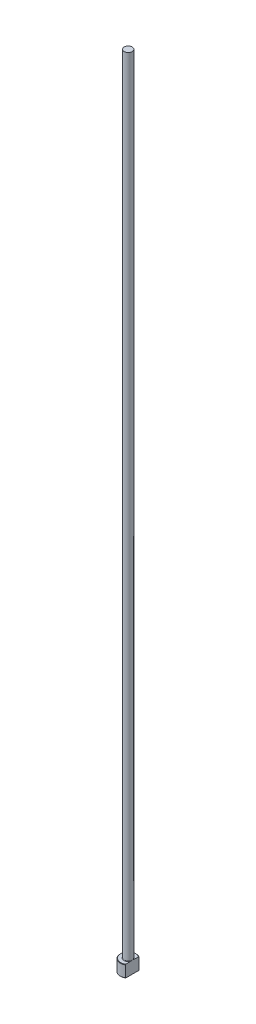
ISO-10303-21;
HEADER;
FILE_DESCRIPTION(('STEP AP214'),'2;1');
FILE_NAME('part.step','',(''),(''),'','','');
FILE_SCHEMA(('AUTOMOTIVE_DESIGN { 1 0 10303 214 1 1 1 1 }'));
ENDSEC;
DATA;
#1=APPLICATION_CONTEXT('core data for automotive mechanical design processes');
#2=APPLICATION_PROTOCOL_DEFINITION('international standard','automotive_design',2000,#1);
#3=PRODUCT_CONTEXT('',#1,'mechanical');
#4=PRODUCT('Part','Part','',(#3));
#5=PRODUCT_RELATED_PRODUCT_CATEGORY('part','',(#4));
#6=PRODUCT_DEFINITION_FORMATION('','',#4);
#7=PRODUCT_DEFINITION_CONTEXT('part definition',#1,'design');
#8=PRODUCT_DEFINITION('design','',#6,#7);
#9=PRODUCT_DEFINITION_SHAPE('','',#8);
#10=(LENGTH_UNIT() NAMED_UNIT(*) SI_UNIT(.MILLI.,.METRE.));
#11=(NAMED_UNIT(*) PLANE_ANGLE_UNIT() SI_UNIT($,.RADIAN.));
#12=(NAMED_UNIT(*) SI_UNIT($,.STERADIAN.) SOLID_ANGLE_UNIT());
#13=UNCERTAINTY_MEASURE_WITH_UNIT(LENGTH_MEASURE(1.E-05),#10,'distance_accuracy_value','');
#14=(GEOMETRIC_REPRESENTATION_CONTEXT(3) GLOBAL_UNCERTAINTY_ASSIGNED_CONTEXT((#13)) GLOBAL_UNIT_ASSIGNED_CONTEXT((#10,
#11,#12)) REPRESENTATION_CONTEXT('',''));
#15=CARTESIAN_POINT('',(0.,0.,0.));
#16=DIRECTION('',(0.,0.,1.));
#17=DIRECTION('',(1.,0.,0.));
#18=AXIS2_PLACEMENT_3D('',#15,#16,#17);
#19=CARTESIAN_POINT('',(0.,0.,0.));
#20=DIRECTION('',(0.,-1.,0.));
#21=DIRECTION('',(0.,0.,-1.));
#22=AXIS2_PLACEMENT_3D('',#19,#20,#21);
#23=PLANE('',#22);
#24=CARTESIAN_POINT('',(0.,0.,0.));
#25=DIRECTION('',(0.,-1.,0.));
#26=DIRECTION('',(0.,0.,-1.));
#27=AXIS2_PLACEMENT_3D('',#24,#25,#26);
#28=CIRCLE('',#27,3.80000000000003);
#29=CARTESIAN_POINT('',(1.99999999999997,0.,3.23109888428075));
#30=VERTEX_POINT('',#29);
#31=CARTESIAN_POINT('',(1.99999999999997,0.,-3.23109888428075));
#32=VERTEX_POINT('',#31);
#33=EDGE_CURVE('E98',#30,#32,#28,.T.);
#34=ORIENTED_EDGE('',*,*,#33,.T.);
#35=DIRECTION('',(0.,0.,1.));
#36=VECTOR('',#35,1.);
#37=CARTESIAN_POINT('',(1.99999999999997,0.,3.46410161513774));
#38=LINE('',#37,#36);
#39=EDGE_CURVE('E83',#32,#30,#38,.T.);
#40=ORIENTED_EDGE('',*,*,#39,.T.);
#41=EDGE_LOOP('',(#34,#40));
#42=FACE_BOUND('',#41,.T.);
#43=ADVANCED_FACE('F32',(#42),#23,.T.);
#44=CARTESIAN_POINT('',(0.,259.958771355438,0.));
#45=DIRECTION('',(0.,1.,0.));
#46=DIRECTION('',(0.,0.,1.));
#47=AXIS2_PLACEMENT_3D('',#44,#45,#46);
#48=CYLINDRICAL_SURFACE('',#47,3.99999999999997);
#49=CARTESIAN_POINT('',(0.,5.79999999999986,0.));
#50=DIRECTION('',(0.,1.,0.));
#51=DIRECTION('',(0.,0.,1.));
#52=AXIS2_PLACEMENT_3D('',#49,#50,#51);
#53=CIRCLE('',#52,3.99999999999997);
#54=CARTESIAN_POINT('',(1.99999999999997,5.79999999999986,3.46410161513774));
#55=VERTEX_POINT('',#54);
#56=CARTESIAN_POINT('',(1.99999999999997,5.79999999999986,-3.46410161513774));
#57=VERTEX_POINT('',#56);
#58=EDGE_CURVE('E104',#55,#57,#53,.F.);
#59=ORIENTED_EDGE('',*,*,#58,.T.);
#60=DIRECTION('',(0.,-1.,0.));
#61=VECTOR('',#60,1.);
#62=CARTESIAN_POINT('',(1.99999999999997,400.,-3.46410161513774));
#63=LINE('',#62,#61);
#64=CARTESIAN_POINT('',(1.99999999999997,0.199999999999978,-3.46410161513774));
#65=VERTEX_POINT('',#64);
#66=EDGE_CURVE('E183',#57,#65,#63,.T.);
#67=ORIENTED_EDGE('',*,*,#66,.T.);
#68=CARTESIAN_POINT('',(0.,0.199999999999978,0.));
#69=DIRECTION('',(0.,-1.,0.));
#70=DIRECTION('',(0.,0.,-1.));
#71=AXIS2_PLACEMENT_3D('',#68,#69,#70);
#72=CIRCLE('',#71,3.99999999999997);
#73=CARTESIAN_POINT('',(1.99999999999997,0.199999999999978,3.46410161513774));
#74=VERTEX_POINT('',#73);
#75=EDGE_CURVE('E100',#65,#74,#72,.F.);
#76=ORIENTED_EDGE('',*,*,#75,.T.);
#77=DIRECTION('',(0.,-1.,0.));
#78=VECTOR('',#77,1.);
#79=CARTESIAN_POINT('',(1.99999999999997,400.,3.46410161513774));
#80=LINE('',#79,#78);
#81=EDGE_CURVE('E93',#55,#74,#80,.T.);
#82=ORIENTED_EDGE('',*,*,#81,.F.);
#83=EDGE_LOOP('',(#59,#67,#76,#82));
#84=FACE_BOUND('',#83,.T.);
#85=ADVANCED_FACE('F158',(#84),#48,.T.);
#86=CARTESIAN_POINT('',(-3.99999999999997,6.,0.));
#87=DIRECTION('',(0.,1.,0.));
#88=DIRECTION('',(0.,0.,1.));
#89=AXIS2_PLACEMENT_3D('',#86,#87,#88);
#90=PLANE('',#89);
#91=CARTESIAN_POINT('',(0.,6.,0.));
#92=DIRECTION('',(0.,1.,0.));
#93=DIRECTION('',(0.,0.,1.));
#94=AXIS2_PLACEMENT_3D('',#91,#92,#93);
#95=CIRCLE('',#94,3.79999999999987);
#96=CARTESIAN_POINT('',(1.99999999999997,6.,-3.23109888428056));
#97=VERTEX_POINT('',#96);
#98=CARTESIAN_POINT('',(1.99999999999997,6.,3.23109888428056));
#99=VERTEX_POINT('',#98);
#100=EDGE_CURVE('E178',#97,#99,#95,.T.);
#101=ORIENTED_EDGE('',*,*,#100,.T.);
#102=DIRECTION('',(0.,0.,-1.));
#103=VECTOR('',#102,1.);
#104=CARTESIAN_POINT('',(1.99999999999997,6.,0.));
#105=LINE('',#104,#103);
#106=CARTESIAN_POINT('',(1.99999999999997,5.99999999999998,0.916515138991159));
#107=VERTEX_POINT('',#106);
#108=EDGE_CURVE('E57',#99,#107,#105,.T.);
#109=ORIENTED_EDGE('',*,*,#108,.T.);
#110=CARTESIAN_POINT('',(0.,6.,0.));
#111=DIRECTION('',(0.,1.,0.));
#112=DIRECTION('',(0.,0.,1.));
#113=AXIS2_PLACEMENT_3D('',#110,#111,#112);
#114=CIRCLE('',#113,2.19999999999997);
#115=CARTESIAN_POINT('',(1.99999999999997,5.99999999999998,-0.916515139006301));
#116=VERTEX_POINT('',#115);
#117=EDGE_CURVE('E107',#107,#116,#114,.F.);
#118=ORIENTED_EDGE('',*,*,#117,.T.);
#119=EDGE_CURVE('E136',#116,#97,#105,.T.);
#120=ORIENTED_EDGE('',*,*,#119,.T.);
#121=EDGE_LOOP('',(#101,#109,#118,#120));
#122=FACE_BOUND('',#121,.T.);
#123=ADVANCED_FACE('F147',(#122),#90,.T.);
#124=CARTESIAN_POINT('',(0.,6.00000000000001,0.));
#125=DIRECTION('',(0.,-1.,0.));
#126=DIRECTION('',(0.,0.,-1.));
#127=AXIS2_PLACEMENT_3D('',#124,#125,#126);
#128=CONICAL_SURFACE('',#127,3.79999999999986,0.785398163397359);
#129=ORIENTED_EDGE('',*,*,#58,.F.);
#130=CARTESIAN_POINT('',(1.99999999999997,1.91904532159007,7.62295524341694));
#131=CARTESIAN_POINT('',(1.99999999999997,2.08611243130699,7.4502239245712));
#132=CARTESIAN_POINT('',(1.99999999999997,2.25300024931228,7.27731861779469));
#133=CARTESIAN_POINT('',(1.99999999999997,2.58631125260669,6.93105655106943));
#134=CARTESIAN_POINT('',(1.99999999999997,2.75273443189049,6.75769978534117));
#135=CARTESIAN_POINT('',(1.99999999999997,3.0850908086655,6.41034692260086));
#136=CARTESIAN_POINT('',(1.99999999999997,3.2510237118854,6.23635054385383));
#137=CARTESIAN_POINT('',(1.99999999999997,3.58215598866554,5.88766284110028));
#138=CARTESIAN_POINT('',(1.99999999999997,3.74735536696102,5.71297152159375));
#139=CARTESIAN_POINT('',(1.99999999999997,4.07353855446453,5.36616839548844));
#140=CARTESIAN_POINT('',(1.99999999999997,4.23454099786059,5.19407412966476));
#141=CARTESIAN_POINT('',(1.99999999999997,4.55534102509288,4.8487666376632));
#142=CARTESIAN_POINT('',(1.99999999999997,4.71513861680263,4.67555341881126));
#143=CARTESIAN_POINT('',(1.99999999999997,5.03306183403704,4.32766569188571));
#144=CARTESIAN_POINT('',(1.99999999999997,5.19118781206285,4.15299150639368));
#145=CARTESIAN_POINT('',(1.99999999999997,5.50513944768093,3.80159134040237));
#146=CARTESIAN_POINT('',(1.99999999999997,5.66096519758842,3.62486544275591));
#147=CARTESIAN_POINT('',(1.99999999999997,5.90974646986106,3.33722425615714));
#148=CARTESIAN_POINT('',(1.99999999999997,6.00376148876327,3.22722645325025));
#149=CARTESIAN_POINT('',(1.99999999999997,6.19011825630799,3.00579987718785));
#150=CARTESIAN_POINT('',(1.99999999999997,6.28245983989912,2.89437096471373));
#151=CARTESIAN_POINT('',(1.99999999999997,6.46586188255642,2.66849662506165));
#152=CARTESIAN_POINT('',(1.99999999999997,6.5568984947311,2.55403176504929));
#153=CARTESIAN_POINT('',(1.99999999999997,6.7357880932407,2.32266819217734));
#154=CARTESIAN_POINT('',(1.99999999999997,6.82364184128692,2.20577007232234));
#155=CARTESIAN_POINT('',(1.99999999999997,6.9961275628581,1.96688707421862));
#156=CARTESIAN_POINT('',(1.99999999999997,7.08069035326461,1.84485190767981));
#157=CARTESIAN_POINT('',(1.99999999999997,7.24300264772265,1.59599329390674));
#158=CARTESIAN_POINT('',(1.99999999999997,7.32074277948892,1.46916359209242));
#159=CARTESIAN_POINT('',(1.99999999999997,7.42869763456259,1.27510066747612));
#160=CARTESIAN_POINT('',(1.99999999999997,7.46305374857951,1.21018943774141));
#161=CARTESIAN_POINT('',(1.99999999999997,7.52837146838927,1.07868835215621));
#162=CARTESIAN_POINT('',(1.99999999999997,7.55933245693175,1.01209819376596));
#163=CARTESIAN_POINT('',(1.99999999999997,7.64566860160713,0.809894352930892));
#164=CARTESIAN_POINT('',(1.99999999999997,7.69478214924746,0.6713602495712));
#165=CARTESIAN_POINT('',(1.99999999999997,7.74794829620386,0.463657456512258));
#166=CARTESIAN_POINT('',(1.99999999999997,7.76205065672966,0.397033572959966));
#167=CARTESIAN_POINT('',(1.99999999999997,7.78390371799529,0.262728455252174));
#168=CARTESIAN_POINT('',(1.99999999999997,7.79165498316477,0.195047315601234));
#169=CARTESIAN_POINT('',(1.99999999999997,7.80025690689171,0.0594528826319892));
#170=CARTESIAN_POINT('',(1.99999999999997,7.801128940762,-0.0084590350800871));
#171=CARTESIAN_POINT('',(1.99999999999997,7.79596585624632,-0.144020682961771));
#172=CARTESIAN_POINT('',(1.99999999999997,7.78993016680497,-0.211670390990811));
#173=CARTESIAN_POINT('',(1.99999999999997,7.77145363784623,-0.345483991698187));
#174=CARTESIAN_POINT('',(1.99999999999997,7.75906777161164,-0.411655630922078));
#175=CARTESIAN_POINT('',(1.99999999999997,7.72866360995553,-0.542678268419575));
#176=CARTESIAN_POINT('',(1.99999999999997,7.71064463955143,-0.607529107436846));
#177=CARTESIAN_POINT('',(1.99999999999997,7.66972939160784,-0.736064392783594));
#178=CARTESIAN_POINT('',(1.99999999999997,7.64680564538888,-0.79973998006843));
#179=CARTESIAN_POINT('',(1.99999999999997,7.59700147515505,-0.925489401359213));
#180=CARTESIAN_POINT('',(1.99999999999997,7.57012185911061,-0.987563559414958));
#181=CARTESIAN_POINT('',(1.99999999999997,7.48443518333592,-1.17209020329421));
#182=CARTESIAN_POINT('',(1.99999999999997,7.42077407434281,-1.29228210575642));
#183=CARTESIAN_POINT('',(1.99999999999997,7.28502644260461,-1.52785770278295));
#184=CARTESIAN_POINT('',(1.99999999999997,7.21292931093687,-1.6432350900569));
#185=CARTESIAN_POINT('',(1.99999999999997,7.06281517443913,-1.87069387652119));
#186=CARTESIAN_POINT('',(1.99999999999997,6.984775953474,-1.98276048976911));
#187=CARTESIAN_POINT('',(1.99999999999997,6.82481971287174,-2.20397837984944));
#188=CARTESIAN_POINT('',(1.99999999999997,6.74290465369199,-2.31313108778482));
#189=CARTESIAN_POINT('',(1.99999999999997,6.57517222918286,-2.53068545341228));
#190=CARTESIAN_POINT('',(1.99999999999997,6.48931769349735,-2.63905831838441));
#191=CARTESIAN_POINT('',(1.99999999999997,6.31548151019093,-2.85409686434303));
#192=CARTESIAN_POINT('',(1.99999999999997,6.227499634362,-2.96076236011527));
#193=CARTESIAN_POINT('',(1.99999999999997,6.05015030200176,-3.17249211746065));
#194=CARTESIAN_POINT('',(1.99999999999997,5.96078672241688,-3.27755963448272));
#195=CARTESIAN_POINT('',(1.99999999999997,5.78082366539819,-3.48663191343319));
#196=CARTESIAN_POINT('',(1.99999999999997,5.69022416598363,-3.59063665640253));
#197=CARTESIAN_POINT('',(1.99999999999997,5.4479673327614,-3.86612439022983));
#198=CARTESIAN_POINT('',(1.99999999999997,5.29545972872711,-4.0368591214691));
#199=CARTESIAN_POINT('',(1.99999999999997,4.98858070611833,-4.37664803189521));
#200=CARTESIAN_POINT('',(1.99999999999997,4.83420923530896,-4.54570216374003));
#201=CARTESIAN_POINT('',(1.99999999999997,4.52396102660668,-4.88271638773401));
#202=CARTESIAN_POINT('',(1.99999999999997,4.36808300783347,-5.05067529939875));
#203=CARTESIAN_POINT('',(1.99999999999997,4.05530513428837,-5.38563883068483));
#204=CARTESIAN_POINT('',(1.99999999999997,3.89840527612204,-5.55264344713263));
#205=CARTESIAN_POINT('',(1.99999999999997,3.59029018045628,-5.87905385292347));
#206=CARTESIAN_POINT('',(1.99999999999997,3.43910664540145,-6.03848959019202));
#207=CARTESIAN_POINT('',(1.99999999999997,3.13616436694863,-6.35681456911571));
#208=CARTESIAN_POINT('',(1.99999999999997,2.98440562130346,-6.51570380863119));
#209=CARTESIAN_POINT('',(1.99999999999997,2.68059501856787,-6.83286192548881));
#210=CARTESIAN_POINT('',(1.99999999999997,2.52854367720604,-6.99113129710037));
#211=CARTESIAN_POINT('',(1.99999999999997,2.22406035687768,-7.30730102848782));
#212=CARTESIAN_POINT('',(1.99999999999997,2.0716283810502,-7.46520139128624));
#213=CARTESIAN_POINT('',(1.99999999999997,1.91904532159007,-7.62295524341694));
#214=B_SPLINE_CURVE_WITH_KNOTS('',3,(#130,#131,#132,#133,#134,#135,#136,#137,#138,#139,#140,
#141,#142,#143,#144,#145,#146,#147,#148,#149,#150,#151,#152,#153,#154,#155,#156,#157,#158,#159,
#160,#161,#162,#163,#164,#165,#166,#167,#168,#169,#170,#171,#172,#173,#174,#175,#176,#177,#178,
#179,#180,#181,#182,#183,#184,#185,#186,#187,#188,#189,#190,#191,#192,#193,#194,#195,#196,#197,
#198,#199,#200,#201,#202,#203,#204,#205,#206,#207,#208,#209,#210,#211,#212,#213),.UNSPECIFIED.,
.F.,.F.,(4,2,2,2,2,2,2,2,2,2,2,2,2,2,2,2,2,2,2,2,2,2,2,2,2,2,2,2,2,2,2,2,2,2,2,2,2,2,2,2,2,4),
(0.,0.720921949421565,1.4418531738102,2.16315326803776,2.88444869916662,3.59144103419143,
4.29842874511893,5.00526427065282,5.71207135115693,6.14616174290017,6.58029471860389,
7.01901494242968,7.45762947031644,7.90290456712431,8.34878206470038,8.56901415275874,
8.78928621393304,9.22814472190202,9.43219512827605,9.63622739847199,9.839625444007,
10.0430403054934,10.244723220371,10.4464303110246,10.6492980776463,10.8521244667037,
11.2595582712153,11.6675100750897,12.0770700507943,12.4864250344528,12.9011677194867,
13.3159550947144,13.7297367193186,14.1435257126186,14.8302935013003,15.5170805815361,
16.2045145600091,16.891950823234,17.5511045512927,18.2102608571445,18.8686819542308,
19.5270976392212),.UNSPECIFIED.);
#215=EDGE_CURVE('E135',#55,#99,#214,.T.);
#216=ORIENTED_EDGE('',*,*,#215,.T.);
#217=ORIENTED_EDGE('',*,*,#100,.F.);
#218=EDGE_CURVE('E127',#97,#57,#214,.T.);
#219=ORIENTED_EDGE('',*,*,#218,.T.);
#220=EDGE_LOOP('',(#129,#216,#217,#219));
#221=FACE_BOUND('',#220,.T.);
#222=ADVANCED_FACE('F143',(#221),#128,.T.);
#223=CARTESIAN_POINT('',(0.,0.199999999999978,0.));
#224=DIRECTION('',(0.,1.,0.));
#225=DIRECTION('',(0.,0.,1.));
#226=AXIS2_PLACEMENT_3D('',#223,#224,#225);
#227=CONICAL_SURFACE('',#226,3.99999999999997,0.785398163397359);
#228=ORIENTED_EDGE('',*,*,#75,.F.);
#229=CARTESIAN_POINT('',(1.99999999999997,4.08095467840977,-7.62295524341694));
#230=CARTESIAN_POINT('',(1.99999999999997,3.91388756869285,-7.4502239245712));
#231=CARTESIAN_POINT('',(1.99999999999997,3.74699975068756,-7.27731861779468));
#232=CARTESIAN_POINT('',(1.99999999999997,3.41368874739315,-6.93105655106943));
#233=CARTESIAN_POINT('',(1.99999999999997,3.24726556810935,-6.75769978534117));
#234=CARTESIAN_POINT('',(1.99999999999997,2.91490919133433,-6.41034692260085));
#235=CARTESIAN_POINT('',(1.99999999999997,2.74897628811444,-6.23635054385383));
#236=CARTESIAN_POINT('',(1.99999999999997,2.4178440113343,-5.88766284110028));
#237=CARTESIAN_POINT('',(1.99999999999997,2.25264463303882,-5.71297152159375));
#238=CARTESIAN_POINT('',(1.99999999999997,1.92646144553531,-5.36616839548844));
#239=CARTESIAN_POINT('',(1.99999999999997,1.76545900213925,-5.19407412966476));
#240=CARTESIAN_POINT('',(1.99999999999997,1.44465897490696,-4.8487666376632));
#241=CARTESIAN_POINT('',(1.99999999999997,1.28486138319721,-4.67555341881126));
#242=CARTESIAN_POINT('',(1.99999999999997,0.966938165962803,-4.32766569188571));
#243=CARTESIAN_POINT('',(1.99999999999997,0.808812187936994,-4.15299150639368));
#244=CARTESIAN_POINT('',(1.99999999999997,0.494860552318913,-3.80159134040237));
#245=CARTESIAN_POINT('',(1.99999999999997,0.339034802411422,-3.62486544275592));
#246=CARTESIAN_POINT('',(1.99999999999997,0.0902535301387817,-3.33722425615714));
#247=CARTESIAN_POINT('',(1.99999999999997,-0.00376148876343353,-3.22722645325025));
#248=CARTESIAN_POINT('',(1.99999999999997,-0.190118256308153,-3.00579987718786));
#249=CARTESIAN_POINT('',(1.99999999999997,-0.282459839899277,-2.89437096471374));
#250=CARTESIAN_POINT('',(1.99999999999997,-0.465861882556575,-2.66849662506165));
#251=CARTESIAN_POINT('',(1.99999999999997,-0.55689849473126,-2.5540317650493));
#252=CARTESIAN_POINT('',(1.99999999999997,-0.735788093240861,-2.32266819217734));
#253=CARTESIAN_POINT('',(1.99999999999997,-0.823641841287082,-2.20577007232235));
#254=CARTESIAN_POINT('',(1.99999999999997,-0.996127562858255,-1.96688707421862));
#255=CARTESIAN_POINT('',(1.99999999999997,-1.08069035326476,-1.84485190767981));
#256=CARTESIAN_POINT('',(1.99999999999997,-1.24300264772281,-1.59599329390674));
#257=CARTESIAN_POINT('',(1.99999999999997,-1.32074277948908,-1.46916359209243));
#258=CARTESIAN_POINT('',(1.99999999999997,-1.42869763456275,-1.27510066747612));
#259=CARTESIAN_POINT('',(1.99999999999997,-1.46305374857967,-1.21018943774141));
#260=CARTESIAN_POINT('',(1.99999999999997,-1.52837146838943,-1.07868835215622));
#261=CARTESIAN_POINT('',(1.99999999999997,-1.55933245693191,-1.01209819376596));
#262=CARTESIAN_POINT('',(1.99999999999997,-1.64566860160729,-0.809894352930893));
#263=CARTESIAN_POINT('',(1.99999999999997,-1.69478214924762,-0.671360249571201));
#264=CARTESIAN_POINT('',(1.99999999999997,-1.74794829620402,-0.463657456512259));
#265=CARTESIAN_POINT('',(1.99999999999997,-1.76205065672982,-0.397033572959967));
#266=CARTESIAN_POINT('',(1.99999999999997,-1.78390371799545,-0.262728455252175));
#267=CARTESIAN_POINT('',(1.99999999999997,-1.79165498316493,-0.195047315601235));
#268=CARTESIAN_POINT('',(1.99999999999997,-1.80025690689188,-0.0594528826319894));
#269=CARTESIAN_POINT('',(1.99999999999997,-1.80112894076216,0.00845903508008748));
#270=CARTESIAN_POINT('',(1.99999999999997,-1.79596585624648,0.144020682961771));
#271=CARTESIAN_POINT('',(1.99999999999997,-1.78993016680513,0.21167039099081));
#272=CARTESIAN_POINT('',(1.99999999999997,-1.77145363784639,0.345483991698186));
#273=CARTESIAN_POINT('',(1.99999999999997,-1.75906777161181,0.411655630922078));
#274=CARTESIAN_POINT('',(1.99999999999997,-1.72866360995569,0.542678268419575));
#275=CARTESIAN_POINT('',(1.99999999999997,-1.71064463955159,0.607529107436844));
#276=CARTESIAN_POINT('',(1.99999999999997,-1.66972939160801,0.736064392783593));
#277=CARTESIAN_POINT('',(1.99999999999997,-1.64680564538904,0.79973998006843));
#278=CARTESIAN_POINT('',(1.99999999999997,-1.59700147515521,0.925489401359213));
#279=CARTESIAN_POINT('',(1.99999999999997,-1.57012185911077,0.987563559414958));
#280=CARTESIAN_POINT('',(1.99999999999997,-1.48443518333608,1.17209020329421));
#281=CARTESIAN_POINT('',(1.99999999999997,-1.42077407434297,1.29228210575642));
#282=CARTESIAN_POINT('',(1.99999999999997,-1.28502644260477,1.52785770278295));
#283=CARTESIAN_POINT('',(1.99999999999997,-1.21292931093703,1.6432350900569));
#284=CARTESIAN_POINT('',(1.99999999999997,-1.0628151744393,1.87069387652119));
#285=CARTESIAN_POINT('',(1.99999999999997,-0.984775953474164,1.98276048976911));
#286=CARTESIAN_POINT('',(1.99999999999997,-0.824819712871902,2.20397837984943));
#287=CARTESIAN_POINT('',(1.99999999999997,-0.742904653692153,2.31313108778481));
#288=CARTESIAN_POINT('',(1.99999999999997,-0.575172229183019,2.53068545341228));
#289=CARTESIAN_POINT('',(1.99999999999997,-0.489317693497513,2.63905831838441));
#290=CARTESIAN_POINT('',(1.99999999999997,-0.315481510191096,2.85409686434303));
#291=CARTESIAN_POINT('',(1.99999999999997,-0.227499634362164,2.96076236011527));
#292=CARTESIAN_POINT('',(1.99999999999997,-0.0501503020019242,3.17249211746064));
#293=CARTESIAN_POINT('',(1.99999999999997,0.0392132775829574,3.27755963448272));
#294=CARTESIAN_POINT('',(1.99999999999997,0.219176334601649,3.48663191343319));
#295=CARTESIAN_POINT('',(1.99999999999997,0.309775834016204,3.59063665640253));
#296=CARTESIAN_POINT('',(1.99999999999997,0.552032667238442,3.86612439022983));
#297=CARTESIAN_POINT('',(1.99999999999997,0.704540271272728,4.0368591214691));
#298=CARTESIAN_POINT('',(1.99999999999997,1.01141929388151,4.37664803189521));
#299=CARTESIAN_POINT('',(1.99999999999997,1.16579076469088,4.54570216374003));
#300=CARTESIAN_POINT('',(1.99999999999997,1.47603897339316,4.88271638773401));
#301=CARTESIAN_POINT('',(1.99999999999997,1.63191699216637,5.05067529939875));
#302=CARTESIAN_POINT('',(1.99999999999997,1.94469486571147,5.38563883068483));
#303=CARTESIAN_POINT('',(1.99999999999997,2.1015947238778,5.55264344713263));
#304=CARTESIAN_POINT('',(1.99999999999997,2.40970981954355,5.87905385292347));
#305=CARTESIAN_POINT('',(1.99999999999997,2.56089335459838,6.03848959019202));
#306=CARTESIAN_POINT('',(1.99999999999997,2.8638356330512,6.3568145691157));
#307=CARTESIAN_POINT('',(1.99999999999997,3.01559437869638,6.51570380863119));
#308=CARTESIAN_POINT('',(1.99999999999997,3.31940498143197,6.83286192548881));
#309=CARTESIAN_POINT('',(1.99999999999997,3.4714563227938,6.99113129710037));
#310=CARTESIAN_POINT('',(1.99999999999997,3.77593964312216,7.30730102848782));
#311=CARTESIAN_POINT('',(1.99999999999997,3.92837161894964,7.46520139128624));
#312=CARTESIAN_POINT('',(1.99999999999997,4.08095467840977,7.62295524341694));
#313=B_SPLINE_CURVE_WITH_KNOTS('',3,(#229,#230,#231,#232,#233,#234,#235,#236,#237,#238,#239,
#240,#241,#242,#243,#244,#245,#246,#247,#248,#249,#250,#251,#252,#253,#254,#255,#256,#257,#258,
#259,#260,#261,#262,#263,#264,#265,#266,#267,#268,#269,#270,#271,#272,#273,#274,#275,#276,#277,
#278,#279,#280,#281,#282,#283,#284,#285,#286,#287,#288,#289,#290,#291,#292,#293,#294,#295,#296,
#297,#298,#299,#300,#301,#302,#303,#304,#305,#306,#307,#308,#309,#310,#311,#312),.UNSPECIFIED.,
.F.,.F.,(4,2,2,2,2,2,2,2,2,2,2,2,2,2,2,2,2,2,2,2,2,2,2,2,2,2,2,2,2,2,2,2,2,2,2,2,2,2,2,2,2,4),
(0.,0.720921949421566,1.4418531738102,2.16315326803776,2.88444869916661,3.59144103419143,
4.29842874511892,5.00526427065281,5.71207135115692,6.14616174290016,6.58029471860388,
7.01901494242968,7.45762947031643,7.90290456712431,8.34878206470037,8.56901415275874,
8.78928621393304,9.22814472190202,9.43219512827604,9.63622739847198,9.839625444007,
10.0430403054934,10.244723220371,10.4464303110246,10.6492980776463,10.8521244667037,
11.2595582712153,11.6675100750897,12.0770700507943,12.4864250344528,12.9011677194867,
13.3159550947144,13.7297367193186,14.1435257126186,14.8302935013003,15.5170805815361,
16.2045145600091,16.891950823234,17.5511045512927,18.2102608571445,18.8686819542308,
19.5270976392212),.UNSPECIFIED.);
#314=EDGE_CURVE('E86',#65,#32,#313,.T.);
#315=ORIENTED_EDGE('',*,*,#314,.T.);
#316=ORIENTED_EDGE('',*,*,#33,.F.);
#317=EDGE_CURVE('E89',#30,#74,#313,.T.);
#318=ORIENTED_EDGE('',*,*,#317,.T.);
#319=EDGE_LOOP('',(#228,#315,#316,#318));
#320=FACE_BOUND('',#319,.T.);
#321=ADVANCED_FACE('F97',(#320),#227,.T.);
#322=CARTESIAN_POINT('',(0.,6.19999999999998,0.));
#323=DIRECTION('',(0.,1.,0.));
#324=DIRECTION('',(0.,0.,1.));
#325=AXIS2_PLACEMENT_3D('',#322,#323,#324);
#326=TOROIDAL_SURFACE('',#325,2.19999999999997,0.2);
#327=CARTESIAN_POINT('',(1.99999999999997,6.19999999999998,0.));
#328=CARTESIAN_POINT('',(1.99999999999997,6.20000050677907,1.13930197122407E-10));
#329=CARTESIAN_POINT('',(1.99999999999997,6.20000101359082,-1.46766795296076E-07));
#330=CARTESIAN_POINT('',(1.99999999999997,6.20000197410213,-5.82067450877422E-07));
#331=CARTESIAN_POINT('',(1.99999999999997,6.20000242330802,-8.77873017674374E-07));
#332=CARTESIAN_POINT('',(1.99999999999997,6.2000033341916,-1.58424515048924E-06));
#333=CARTESIAN_POINT('',(1.99999999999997,6.20000378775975,-2.00534283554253E-06));
#334=CARTESIAN_POINT('',(1.99999999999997,6.20000462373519,-2.89558841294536E-06));
#335=CARTESIAN_POINT('',(1.99999999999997,6.20000500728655,-3.36372325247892E-06));
#336=CARTESIAN_POINT('',(1.99999999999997,6.20000636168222,-5.10887550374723E-06));
#337=CARTESIAN_POINT('',(1.99999999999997,6.20000725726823,-6.44597279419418E-06));
#338=CARTESIAN_POINT('',(1.99999999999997,6.20000879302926,-9.14926716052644E-06));
#339=CARTESIAN_POINT('',(1.99999999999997,6.20000944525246,-1.05089714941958E-05));
#340=CARTESIAN_POINT('',(1.99999999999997,6.20001204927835,-1.60555880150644E-05));
#341=CARTESIAN_POINT('',(1.99999999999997,6.20001390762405,-2.02908747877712E-05));
#342=CARTESIAN_POINT('',(1.99999999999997,6.20001676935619,-2.8443849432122E-05));
#343=CARTESIAN_POINT('',(1.99999999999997,6.20001785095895,-3.23343259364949E-05));
#344=CARTESIAN_POINT('',(1.99999999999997,6.20002551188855,-6.06027145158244E-05));
#345=CARTESIAN_POINT('',(1.99999999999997,6.20003111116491,-8.51991847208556E-05));
#346=CARTESIAN_POINT('',(1.99999999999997,6.20005559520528,-0.000181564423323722));
#347=CARTESIAN_POINT('',(1.99999999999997,6.20007914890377,-0.000252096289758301));
#348=CARTESIAN_POINT('',(1.99999999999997,6.20017002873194,-0.000529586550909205));
#349=CARTESIAN_POINT('',(1.99999999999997,6.20023415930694,-0.000737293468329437));
#350=CARTESIAN_POINT('',(1.99999999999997,6.20048926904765,-0.00155657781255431));
#351=CARTESIAN_POINT('',(1.99999999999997,6.2006841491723,-0.00216722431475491));
#352=CARTESIAN_POINT('',(1.99999999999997,6.20148805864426,-0.00469384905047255));
#353=CARTESIAN_POINT('',(1.99999999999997,6.20209226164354,-0.00661098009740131));
#354=CARTESIAN_POINT('',(1.99999999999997,6.20822779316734,-0.0260695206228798));
#355=CARTESIAN_POINT('',(1.99999999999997,6.21378174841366,-0.0436057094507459));
#356=CARTESIAN_POINT('',(1.99999999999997,6.22462834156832,-0.0780127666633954));
#357=CARTESIAN_POINT('',(1.99999999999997,6.22992277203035,-0.0948831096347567));
#358=CARTESIAN_POINT('',(1.99999999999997,6.24110477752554,-0.130713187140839));
#359=CARTESIAN_POINT('',(1.99999999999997,6.24698536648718,-0.149675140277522));
#360=CARTESIAN_POINT('',(1.99999999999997,6.25869835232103,-0.187834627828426));
#361=CARTESIAN_POINT('',(1.99999999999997,6.26452957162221,-0.20703252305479));
#362=CARTESIAN_POINT('',(1.99999999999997,6.27861584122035,-0.254071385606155));
#363=CARTESIAN_POINT('',(1.99999999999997,6.28678835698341,-0.281937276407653));
#364=CARTESIAN_POINT('',(1.99999999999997,6.30249503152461,-0.33711523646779));
#365=CARTESIAN_POINT('',(1.99999999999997,6.31003989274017,-0.364424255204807));
#366=CARTESIAN_POINT('',(1.99999999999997,6.32554795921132,-0.422841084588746));
#367=CARTESIAN_POINT('',(1.99999999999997,6.33343288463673,-0.453970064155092));
#368=CARTESIAN_POINT('',(1.99999999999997,6.34833120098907,-0.516667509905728));
#369=CARTESIAN_POINT('',(1.99999999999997,6.3553379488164,-0.548237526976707));
#370=CARTESIAN_POINT('',(1.99999999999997,6.37554978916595,-0.647984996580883));
#371=CARTESIAN_POINT('',(1.99999999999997,6.38665117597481,-0.716635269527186));
#372=CARTESIAN_POINT('',(1.99999999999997,6.39785773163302,-0.8324457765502));
#373=CARTESIAN_POINT('',(1.99999999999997,6.40036304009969,-0.879345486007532));
#374=CARTESIAN_POINT('',(1.99999999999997,6.39976024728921,-0.949238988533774));
#375=CARTESIAN_POINT('',(1.99999999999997,6.39886048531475,-0.97224857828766));
#376=CARTESIAN_POINT('',(1.99999999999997,6.39534463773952,-1.01812773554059));
#377=CARTESIAN_POINT('',(1.99999999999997,6.39273014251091,-1.04099741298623));
#378=CARTESIAN_POINT('',(1.99999999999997,6.38623968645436,-1.08102660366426));
#379=CARTESIAN_POINT('',(1.99999999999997,6.38280841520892,-1.09825717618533));
#380=CARTESIAN_POINT('',(1.99999999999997,6.37442567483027,-1.13243508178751));
#381=CARTESIAN_POINT('',(1.99999999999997,6.36946777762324,-1.14938089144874));
#382=CARTESIAN_POINT('',(1.99999999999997,6.35764172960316,-1.18276398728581));
#383=CARTESIAN_POINT('',(1.99999999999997,6.35075810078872,-1.1991959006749));
#384=CARTESIAN_POINT('',(1.99999999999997,6.33462082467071,-1.23083581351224));
#385=CARTESIAN_POINT('',(1.99999999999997,6.32537783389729,-1.24604892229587));
#386=CARTESIAN_POINT('',(1.99999999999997,6.30929159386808,-1.26715296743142));
#387=CARTESIAN_POINT('',(1.99999999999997,6.303567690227,-1.27389441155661));
#388=CARTESIAN_POINT('',(1.99999999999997,6.29128925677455,-1.28659894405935));
#389=CARTESIAN_POINT('',(1.99999999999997,6.28473413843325,-1.29256147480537));
#390=CARTESIAN_POINT('',(1.99999999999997,6.27066594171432,-1.30346436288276));
#391=CARTESIAN_POINT('',(1.99999999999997,6.26314132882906,-1.30839014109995));
#392=CARTESIAN_POINT('',(1.99999999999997,6.24727957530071,-1.31668687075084));
#393=CARTESIAN_POINT('',(1.99999999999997,6.23894498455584,-1.32006252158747));
#394=CARTESIAN_POINT('',(1.99999999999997,6.22424089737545,-1.3241557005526));
#395=CARTESIAN_POINT('',(1.99999999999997,6.21800630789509,-1.32536112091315));
#396=CARTESIAN_POINT('',(1.99999999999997,6.2054226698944,-1.32669615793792));
#397=CARTESIAN_POINT('',(1.99999999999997,6.19907368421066,-1.32682634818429));
#398=CARTESIAN_POINT('',(1.99999999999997,6.18645152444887,-1.32599950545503));
#399=CARTESIAN_POINT('',(1.99999999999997,6.18017831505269,-1.32504300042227));
#400=CARTESIAN_POINT('',(1.99999999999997,6.16787181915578,-1.32212308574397));
#401=CARTESIAN_POINT('',(1.99999999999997,6.16183869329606,-1.32015901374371));
#402=CARTESIAN_POINT('',(1.99999999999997,6.14844260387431,-1.31466566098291));
#403=CARTESIAN_POINT('',(1.99999999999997,6.14119825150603,-1.3108482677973));
#404=CARTESIAN_POINT('',(1.99999999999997,6.12742328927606,-1.30209252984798));
#405=CARTESIAN_POINT('',(1.99999999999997,6.12089414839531,-1.29715193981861));
#406=CARTESIAN_POINT('',(1.99999999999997,6.10554761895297,-1.28382084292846));
#407=CARTESIAN_POINT('',(1.99999999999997,6.09717242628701,-1.27492468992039));
#408=CARTESIAN_POINT('',(1.99999999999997,6.08188323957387,-1.25597903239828));
#409=CARTESIAN_POINT('',(1.99999999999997,6.07497120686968,-1.24592800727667));
#410=CARTESIAN_POINT('',(1.99999999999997,6.05771073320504,-1.21734573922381));
#411=CARTESIAN_POINT('',(1.99999999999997,6.04862251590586,-1.19806017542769));
#412=CARTESIAN_POINT('',(1.99999999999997,6.03323781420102,-1.15830155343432));
#413=CARTESIAN_POINT('',(1.99999999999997,6.02696471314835,-1.13782009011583));
#414=CARTESIAN_POINT('',(1.99999999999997,6.01659159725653,-1.09607450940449));
#415=CARTESIAN_POINT('',(1.99999999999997,6.01251776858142,-1.07480405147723));
#416=CARTESIAN_POINT('',(1.99999999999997,6.0061890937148,-1.03196822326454));
#417=CARTESIAN_POINT('',(1.99999999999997,6.00393768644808,-1.0104023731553));
#418=CARTESIAN_POINT('',(1.99999999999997,5.99950887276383,-0.946948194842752));
#419=CARTESIAN_POINT('',(1.99999999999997,5.99937097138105,-0.904921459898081));
#420=CARTESIAN_POINT('',(1.99999999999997,6.00391139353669,-0.800067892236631));
#421=CARTESIAN_POINT('',(1.99999999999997,6.01103947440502,-0.737378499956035));
#422=CARTESIAN_POINT('',(1.99999999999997,6.0310998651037,-0.611444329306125));
#423=CARTESIAN_POINT('',(1.99999999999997,6.04417074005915,-0.548223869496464));
#424=CARTESIAN_POINT('',(1.99999999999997,6.06920011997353,-0.442888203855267));
#425=CARTESIAN_POINT('',(1.99999999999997,6.08016343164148,-0.400527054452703));
#426=CARTESIAN_POINT('',(1.99999999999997,6.10315303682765,-0.316588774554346));
#427=CARTESIAN_POINT('',(1.99999999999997,6.11516655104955,-0.275008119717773));
#428=CARTESIAN_POINT('',(1.99999999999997,6.13853403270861,-0.196672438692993));
#429=CARTESIAN_POINT('',(1.99999999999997,6.14981294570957,-0.159894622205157));
#430=CARTESIAN_POINT('',(1.99999999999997,6.17316886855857,-0.0849211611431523));
#431=CARTESIAN_POINT('',(1.99999999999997,6.18525959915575,-0.0467297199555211));
#432=CARTESIAN_POINT('',(1.99999999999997,6.19790869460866,-0.00660765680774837));
#433=CARTESIAN_POINT('',(1.99999999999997,6.19851400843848,-0.00468723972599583));
#434=CARTESIAN_POINT('',(1.99999999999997,6.19931818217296,-0.00215985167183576));
#435=CARTESIAN_POINT('',(1.99999999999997,6.19951225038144,-0.00155173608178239));
#436=CARTESIAN_POINT('',(1.99999999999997,6.19976637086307,-0.000735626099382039));
#437=CARTESIAN_POINT('',(1.99999999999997,6.19983030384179,-0.000528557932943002));
#438=CARTESIAN_POINT('',(1.99999999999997,6.19992094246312,-0.000251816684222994));
#439=CARTESIAN_POINT('',(1.99999999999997,6.19994446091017,-0.000181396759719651));
#440=CARTESIAN_POINT('',(1.99999999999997,6.19996891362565,-8.516223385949E-05));
#441=CARTESIAN_POINT('',(1.99999999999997,6.19997450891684,-6.05824645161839E-05));
#442=CARTESIAN_POINT('',(1.99999999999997,6.19998216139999,-3.23308902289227E-05));
#443=CARTESIAN_POINT('',(1.99999999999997,6.19998324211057,-2.84414359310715E-05));
#444=CARTESIAN_POINT('',(1.99999999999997,6.19998610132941,-2.02904710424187E-05));
#445=CARTESIAN_POINT('',(1.99999999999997,6.19998795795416,-1.60561198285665E-05));
#446=CARTESIAN_POINT('',(1.99999999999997,6.19999055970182,-1.05104411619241E-05));
#447=CARTESIAN_POINT('',(1.99999999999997,6.19999121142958,-9.15081316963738E-06));
#448=CARTESIAN_POINT('',(1.99999999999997,6.1999927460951,-6.44758195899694E-06));
#449=CARTESIAN_POINT('',(1.99999999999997,6.19999364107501,-5.11046373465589E-06));
#450=CARTESIAN_POINT('',(1.99999999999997,6.19999499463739,-3.36517635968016E-06));
#451=CARTESIAN_POINT('',(1.99999999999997,6.19999537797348,-2.89697955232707E-06));
#452=CARTESIAN_POINT('',(1.99999999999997,6.19999621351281,-2.00657125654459E-06));
#453=CARTESIAN_POINT('',(1.99999999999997,6.19999666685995,-1.58537196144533E-06));
#454=CARTESIAN_POINT('',(1.99999999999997,6.19999757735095,-8.78757217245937E-07));
#455=CARTESIAN_POINT('',(1.99999999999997,6.19999802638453,-5.82817893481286E-07));
#456=CARTESIAN_POINT('',(1.99999999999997,6.19999898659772,-1.4718673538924E-07));
#457=CARTESIAN_POINT('',(1.99999999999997,6.19999949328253,-1.13916340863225E-10));
#458=CARTESIAN_POINT('',(1.99999999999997,6.19999999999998,0.));
#459=B_SPLINE_CURVE_WITH_KNOTS('',3,(#327,#328,#329,#330,#331,#332,#333,#334,#335,#336,#337,
#338,#339,#340,#341,#342,#343,#344,#345,#346,#347,#348,#349,#350,#351,#352,#353,#354,#355,#356,
#357,#358,#359,#360,#361,#362,#363,#364,#365,#366,#367,#368,#369,#370,#371,#372,#373,#374,#375,
#376,#377,#378,#379,#380,#381,#382,#383,#384,#385,#386,#387,#388,#389,#390,#391,#392,#393,#394,
#395,#396,#397,#398,#399,#400,#401,#402,#403,#404,#405,#406,#407,#408,#409,#410,#411,#412,#413,
#414,#415,#416,#417,#418,#419,#420,#421,#422,#423,#424,#425,#426,#427,#428,#429,#430,#431,#432,
#433,#434,#435,#436,#437,#438,#439,#440,#441,#442,#443,#444,#445,#446,#447,#448,#449,#450,#451,
#452,#453,#454,#455,#456,#457,#458),.UNSPECIFIED.,.T.,.F.,(4,2,2,2,2,2,2,2,2,2,2,2,2,2,2,2,2,2,
2,2,2,2,2,2,2,2,2,2,2,2,2,2,2,2,2,2,2,2,2,2,2,2,2,2,2,2,2,2,2,2,2,2,2,2,2,2,2,2,2,2,2,2,2,2,2,
4),(0.,1.52369882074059E-06,3.13175174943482E-06,4.97933869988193E-06,6.79332712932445E-06,
1.16005918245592E-05,1.61211188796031E-05,2.99630984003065E-05,4.20611839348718E-05,
0.000117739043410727,0.000340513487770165,0.000992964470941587,0.00291555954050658,
0.00894623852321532,0.0641278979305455,0.117173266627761,0.176731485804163,0.236923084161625,
0.324038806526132,0.409031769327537,0.505353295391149,0.602364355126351,0.810598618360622,
0.951214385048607,1.02024793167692,1.08921754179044,1.14187257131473,1.19475241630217,
1.24807013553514,1.30115116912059,1.32762610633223,1.35411989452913,1.38096446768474,
1.40772711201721,1.42669285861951,1.44564848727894,1.46459491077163,1.48355380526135,
1.50798338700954,1.53246223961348,1.56891061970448,1.60540755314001,1.66900939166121,
1.73313017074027,1.7979984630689,1.86298887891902,1.98877684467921,2.17764082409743,
2.37115413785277,2.50240556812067,2.63223743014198,2.74764208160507,2.86781494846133,
2.87385601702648,2.87577064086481,2.87642108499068,2.87664350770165,2.87671913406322,
2.87673122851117,2.87674506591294,2.87674958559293,2.87675439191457,2.87675620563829,
2.87675805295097,2.87675966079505,2.87676118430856),.UNSPECIFIED.);
#460=CARTESIAN_POINT('',(1.99999999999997,6.19999999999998,0.));
#461=VERTEX_POINT('',#460);
#462=EDGE_CURVE('E11',#116,#461,#459,.T.);
#463=ORIENTED_EDGE('',*,*,#462,.F.);
#464=ORIENTED_EDGE('',*,*,#117,.F.);
#465=CARTESIAN_POINT('',(1.99999999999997,6.19999999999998,0.));
#466=CARTESIAN_POINT('',(1.99999999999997,6.19999949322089,-1.13930196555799E-10));
#467=CARTESIAN_POINT('',(1.99999999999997,6.19999898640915,1.4676679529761E-07));
#468=CARTESIAN_POINT('',(1.99999999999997,6.19999802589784,5.82067450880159E-07));
#469=CARTESIAN_POINT('',(1.99999999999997,6.19999757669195,8.77873017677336E-07));
#470=CARTESIAN_POINT('',(1.99999999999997,6.19999666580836,1.58424515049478E-06));
#471=CARTESIAN_POINT('',(1.99999999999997,6.19999621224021,2.00534283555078E-06));
#472=CARTESIAN_POINT('',(1.99999999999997,6.19999537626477,2.89558841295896E-06));
#473=CARTESIAN_POINT('',(1.99999999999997,6.19999499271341,3.3637232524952E-06));
#474=CARTESIAN_POINT('',(1.99999999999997,6.19999363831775,5.10887550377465E-06));
#475=CARTESIAN_POINT('',(1.99999999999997,6.19999274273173,6.44597279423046E-06));
#476=CARTESIAN_POINT('',(1.99999999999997,6.1999912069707,9.14926716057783E-06));
#477=CARTESIAN_POINT('',(1.99999999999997,6.19999055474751,1.05089714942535E-05));
#478=CARTESIAN_POINT('',(1.99999999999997,6.19998795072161,1.60555880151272E-05));
#479=CARTESIAN_POINT('',(1.99999999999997,6.19998609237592,2.02908747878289E-05));
#480=CARTESIAN_POINT('',(1.99999999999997,6.19998323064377,2.84438494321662E-05));
#481=CARTESIAN_POINT('',(1.99999999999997,6.19998214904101,3.23343259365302E-05));
#482=CARTESIAN_POINT('',(1.99999999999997,6.19997448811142,6.06027145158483E-05));
#483=CARTESIAN_POINT('',(1.99999999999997,6.19996888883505,8.51991847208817E-05));
#484=CARTESIAN_POINT('',(1.99999999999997,6.19994440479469,0.000181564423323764));
#485=CARTESIAN_POINT('',(1.99999999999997,6.1999208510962,0.000252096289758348));
#486=CARTESIAN_POINT('',(1.99999999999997,6.19982997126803,0.000529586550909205));
#487=CARTESIAN_POINT('',(1.99999999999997,6.19976584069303,0.000737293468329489));
#488=CARTESIAN_POINT('',(1.99999999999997,6.19951073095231,0.00155657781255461));
#489=CARTESIAN_POINT('',(1.99999999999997,6.19931585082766,0.00216722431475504));
#490=CARTESIAN_POINT('',(1.99999999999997,6.1985119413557,0.00469384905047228));
#491=CARTESIAN_POINT('',(1.99999999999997,6.19790773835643,0.00661098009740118));
#492=CARTESIAN_POINT('',(1.99999999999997,6.19177220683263,0.0260695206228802));
#493=CARTESIAN_POINT('',(1.99999999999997,6.18621825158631,0.0436057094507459));
#494=CARTESIAN_POINT('',(1.99999999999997,6.17537165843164,0.0780127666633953));
#495=CARTESIAN_POINT('',(1.99999999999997,6.17007722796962,0.0948831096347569));
#496=CARTESIAN_POINT('',(1.99999999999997,6.15889522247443,0.130713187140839));
#497=CARTESIAN_POINT('',(1.99999999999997,6.15301463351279,0.149675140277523));
#498=CARTESIAN_POINT('',(1.99999999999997,6.14130164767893,0.187834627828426));
#499=CARTESIAN_POINT('',(1.99999999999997,6.13547042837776,0.20703252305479));
#500=CARTESIAN_POINT('',(1.99999999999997,6.12138415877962,0.254071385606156));
#501=CARTESIAN_POINT('',(1.99999999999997,6.11321164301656,0.281937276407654));
#502=CARTESIAN_POINT('',(1.99999999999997,6.09750496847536,0.337115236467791));
#503=CARTESIAN_POINT('',(1.99999999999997,6.0899601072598,0.364424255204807));
#504=CARTESIAN_POINT('',(1.99999999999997,6.07445204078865,0.422841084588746));
#505=CARTESIAN_POINT('',(1.99999999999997,6.06656711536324,0.453970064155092));
#506=CARTESIAN_POINT('',(1.99999999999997,6.0516687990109,0.516667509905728));
#507=CARTESIAN_POINT('',(1.99999999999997,6.04466205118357,0.548237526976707));
#508=CARTESIAN_POINT('',(1.99999999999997,6.02445021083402,0.647984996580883));
#509=CARTESIAN_POINT('',(1.99999999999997,6.01334882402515,0.716635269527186));
#510=CARTESIAN_POINT('',(1.99999999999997,6.00214226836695,0.8324457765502));
#511=CARTESIAN_POINT('',(1.99999999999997,5.99963695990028,0.879345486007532));
#512=CARTESIAN_POINT('',(1.99999999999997,6.00023975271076,0.949238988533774));
#513=CARTESIAN_POINT('',(1.99999999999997,6.00113951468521,0.97224857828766));
#514=CARTESIAN_POINT('',(1.99999999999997,6.00465536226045,1.01812773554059));
#515=CARTESIAN_POINT('',(1.99999999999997,6.00726985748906,1.04099741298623));
#516=CARTESIAN_POINT('',(1.99999999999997,6.01376031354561,1.08102660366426));
#517=CARTESIAN_POINT('',(1.99999999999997,6.01719158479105,1.09825717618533));
#518=CARTESIAN_POINT('',(1.99999999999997,6.02557432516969,1.13243508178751));
#519=CARTESIAN_POINT('',(1.99999999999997,6.03053222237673,1.14938089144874));
#520=CARTESIAN_POINT('',(1.99999999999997,6.04235827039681,1.18276398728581));
#521=CARTESIAN_POINT('',(1.99999999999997,6.04924189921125,1.1991959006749));
#522=CARTESIAN_POINT('',(1.99999999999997,6.06537917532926,1.23083581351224));
#523=CARTESIAN_POINT('',(1.99999999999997,6.07462216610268,1.24604892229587));
#524=CARTESIAN_POINT('',(1.99999999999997,6.09070840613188,1.26715296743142));
#525=CARTESIAN_POINT('',(1.99999999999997,6.09643230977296,1.27389441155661));
#526=CARTESIAN_POINT('',(1.99999999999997,6.10871074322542,1.28659894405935));
#527=CARTESIAN_POINT('',(1.99999999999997,6.11526586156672,1.29256147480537));
#528=CARTESIAN_POINT('',(1.99999999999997,6.12933405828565,1.30346436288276));
#529=CARTESIAN_POINT('',(1.99999999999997,6.1368586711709,1.30839014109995));
#530=CARTESIAN_POINT('',(1.99999999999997,6.15272042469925,1.31668687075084));
#531=CARTESIAN_POINT('',(1.99999999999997,6.16105501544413,1.32006252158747));
#532=CARTESIAN_POINT('',(1.99999999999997,6.17575910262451,1.3241557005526));
#533=CARTESIAN_POINT('',(1.99999999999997,6.18199369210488,1.32536112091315));
#534=CARTESIAN_POINT('',(1.99999999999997,6.19457733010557,1.32669615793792));
#535=CARTESIAN_POINT('',(1.99999999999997,6.20092631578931,1.32682634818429));
#536=CARTESIAN_POINT('',(1.99999999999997,6.2135484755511,1.32599950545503));
#537=CARTESIAN_POINT('',(1.99999999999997,6.21982168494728,1.32504300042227));
#538=CARTESIAN_POINT('',(1.99999999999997,6.23212818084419,1.32212308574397));
#539=CARTESIAN_POINT('',(1.99999999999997,6.23816130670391,1.32015901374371));
#540=CARTESIAN_POINT('',(1.99999999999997,6.25155739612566,1.31466566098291));
#541=CARTESIAN_POINT('',(1.99999999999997,6.25880174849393,1.3108482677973));
#542=CARTESIAN_POINT('',(1.99999999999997,6.2725767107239,1.30209252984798));
#543=CARTESIAN_POINT('',(1.99999999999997,6.27910585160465,1.29715193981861));
#544=CARTESIAN_POINT('',(1.99999999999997,6.29445238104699,1.28382084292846));
#545=CARTESIAN_POINT('',(1.99999999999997,6.30282757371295,1.27492468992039));
#546=CARTESIAN_POINT('',(1.99999999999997,6.3181167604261,1.25597903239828));
#547=CARTESIAN_POINT('',(1.99999999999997,6.32502879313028,1.24592800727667));
#548=CARTESIAN_POINT('',(1.99999999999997,6.34228926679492,1.21734573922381));
#549=CARTESIAN_POINT('',(1.99999999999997,6.35137748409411,1.19806017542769));
#550=CARTESIAN_POINT('',(1.99999999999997,6.36676218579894,1.15830155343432));
#551=CARTESIAN_POINT('',(1.99999999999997,6.37303528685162,1.13782009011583));
#552=CARTESIAN_POINT('',(1.99999999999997,6.38340840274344,1.09607450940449));
#553=CARTESIAN_POINT('',(1.99999999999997,6.38748223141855,1.07480405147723));
#554=CARTESIAN_POINT('',(1.99999999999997,6.39381090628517,1.03196822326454));
#555=CARTESIAN_POINT('',(1.99999999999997,6.39606231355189,1.0104023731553));
#556=CARTESIAN_POINT('',(1.99999999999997,6.40049112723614,0.946948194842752));
#557=CARTESIAN_POINT('',(1.99999999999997,6.40062902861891,0.904921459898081));
#558=CARTESIAN_POINT('',(1.99999999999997,6.39608860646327,0.800067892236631));
#559=CARTESIAN_POINT('',(1.99999999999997,6.38896052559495,0.737378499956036));
#560=CARTESIAN_POINT('',(1.99999999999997,6.36890013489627,0.611444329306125));
#561=CARTESIAN_POINT('',(1.99999999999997,6.35582925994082,0.548223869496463));
#562=CARTESIAN_POINT('',(1.99999999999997,6.33079988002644,0.442888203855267));
#563=CARTESIAN_POINT('',(1.99999999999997,6.31983656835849,0.400527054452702));
#564=CARTESIAN_POINT('',(1.99999999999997,6.29684696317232,0.316588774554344));
#565=CARTESIAN_POINT('',(1.99999999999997,6.28483344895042,0.27500811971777));
#566=CARTESIAN_POINT('',(1.99999999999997,6.26146596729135,0.196672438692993));
#567=CARTESIAN_POINT('',(1.99999999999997,6.25018705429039,0.159894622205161));
#568=CARTESIAN_POINT('',(1.99999999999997,6.22683113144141,0.0849211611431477));
#569=CARTESIAN_POINT('',(1.99999999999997,6.21474040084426,0.0467297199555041));
#570=CARTESIAN_POINT('',(1.99999999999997,6.20209130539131,0.00660765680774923));
#571=CARTESIAN_POINT('',(1.99999999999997,6.20148599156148,0.00468723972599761));
#572=CARTESIAN_POINT('',(1.99999999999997,6.20068181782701,0.00215985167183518));
#573=CARTESIAN_POINT('',(1.99999999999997,6.20048774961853,0.00155173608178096));
#574=CARTESIAN_POINT('',(1.99999999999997,6.2002336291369,0.000735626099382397));
#575=CARTESIAN_POINT('',(1.99999999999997,6.20016969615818,0.000528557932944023));
#576=CARTESIAN_POINT('',(1.99999999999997,6.20007905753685,0.000251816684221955));
#577=CARTESIAN_POINT('',(1.99999999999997,6.2000555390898,0.000181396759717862));
#578=CARTESIAN_POINT('',(1.99999999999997,6.20003108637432,8.51622338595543E-05));
#579=CARTESIAN_POINT('',(1.99999999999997,6.20002549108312,6.05824645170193E-05));
#580=CARTESIAN_POINT('',(1.99999999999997,6.20001783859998,3.23308902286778E-05));
#581=CARTESIAN_POINT('',(1.99999999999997,6.2000167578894,2.84414359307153E-05));
#582=CARTESIAN_POINT('',(1.99999999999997,6.20001389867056,2.02904710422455E-05));
#583=CARTESIAN_POINT('',(1.99999999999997,6.20001204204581,1.60561198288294E-05));
#584=CARTESIAN_POINT('',(1.99999999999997,6.20000944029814,1.05104411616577E-05));
#585=CARTESIAN_POINT('',(1.99999999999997,6.20000878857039,9.15081316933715E-06));
#586=CARTESIAN_POINT('',(1.99999999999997,6.20000725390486,6.44758195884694E-06));
#587=CARTESIAN_POINT('',(1.99999999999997,6.20000635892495,5.11046373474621E-06));
#588=CARTESIAN_POINT('',(1.99999999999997,6.20000500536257,3.36517635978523E-06));
#589=CARTESIAN_POINT('',(1.99999999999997,6.20000462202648,2.89697955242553E-06));
#590=CARTESIAN_POINT('',(1.99999999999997,6.20000378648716,2.00657125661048E-06));
#591=CARTESIAN_POINT('',(1.99999999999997,6.20000333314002,1.58537196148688E-06));
#592=CARTESIAN_POINT('',(1.99999999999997,6.20000242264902,8.78757217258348E-07));
#593=CARTESIAN_POINT('',(1.99999999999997,6.20000197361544,5.8281789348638E-07));
#594=CARTESIAN_POINT('',(1.99999999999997,6.20000101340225,1.47186735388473E-07));
#595=CARTESIAN_POINT('',(1.99999999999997,6.20000050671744,1.13916340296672E-10));
#596=CARTESIAN_POINT('',(1.99999999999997,6.19999999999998,0.));
#597=B_SPLINE_CURVE_WITH_KNOTS('',3,(#465,#466,#467,#468,#469,#470,#471,#472,#473,#474,#475,
#476,#477,#478,#479,#480,#481,#482,#483,#484,#485,#486,#487,#488,#489,#490,#491,#492,#493,#494,
#495,#496,#497,#498,#499,#500,#501,#502,#503,#504,#505,#506,#507,#508,#509,#510,#511,#512,#513,
#514,#515,#516,#517,#518,#519,#520,#521,#522,#523,#524,#525,#526,#527,#528,#529,#530,#531,#532,
#533,#534,#535,#536,#537,#538,#539,#540,#541,#542,#543,#544,#545,#546,#547,#548,#549,#550,#551,
#552,#553,#554,#555,#556,#557,#558,#559,#560,#561,#562,#563,#564,#565,#566,#567,#568,#569,#570,
#571,#572,#573,#574,#575,#576,#577,#578,#579,#580,#581,#582,#583,#584,#585,#586,#587,#588,#589,
#590,#591,#592,#593,#594,#595,#596),.UNSPECIFIED.,.T.,.F.,(4,2,2,2,2,2,2,2,2,2,2,2,2,2,2,2,2,2,
2,2,2,2,2,2,2,2,2,2,2,2,2,2,2,2,2,2,2,2,2,2,2,2,2,2,2,2,2,2,2,2,2,2,2,2,2,2,2,2,2,2,2,2,2,2,2,
4),(0.,1.52369882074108E-06,3.13175174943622E-06,4.97933869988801E-06,6.79332712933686E-06,
1.16005918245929E-05,1.61211188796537E-05,2.99630984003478E-05,4.20611839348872E-05,
0.000117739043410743,0.000340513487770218,0.000992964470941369,0.00291555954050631,
0.00894623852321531,0.0641278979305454,0.117173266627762,0.176731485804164,0.236923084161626,
0.324038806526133,0.409031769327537,0.505353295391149,0.602364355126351,0.810598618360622,
0.951214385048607,1.02024793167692,1.08921754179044,1.14187257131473,1.19475241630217,
1.24807013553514,1.30115116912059,1.32762610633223,1.35411989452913,1.38096446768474,
1.40772711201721,1.42669285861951,1.44564848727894,1.46459491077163,1.48355380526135,
1.50798338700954,1.53246223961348,1.56891061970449,1.60540755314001,1.66900939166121,
1.73313017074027,1.7979984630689,1.86298887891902,1.98877684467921,2.17764082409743,
2.37115413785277,2.50240556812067,2.63223743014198,2.74764208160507,2.86781494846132,
2.87385601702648,2.8757706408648,2.87642108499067,2.87664350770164,2.87671913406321,
2.87673122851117,2.87674506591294,2.87674958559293,2.87675439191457,2.87675620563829,
2.87675805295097,2.87675966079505,2.87676118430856),.UNSPECIFIED.);
#598=EDGE_CURVE('E46',#461,#107,#597,.T.);
#599=ORIENTED_EDGE('',*,*,#598,.F.);
#600=CARTESIAN_POINT('',(0.,6.19999999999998,0.));
#601=DIRECTION('',(0.,1.,0.));
#602=DIRECTION('',(0.,0.,1.));
#603=AXIS2_PLACEMENT_3D('',#600,#601,#602);
#604=CIRCLE('',#603,1.99999999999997);
#605=EDGE_CURVE('E103',#461,#461,#604,.T.);
#606=ORIENTED_EDGE('',*,*,#605,.F.);
#607=EDGE_LOOP('',(#463,#464,#599,#606));
#608=FACE_BOUND('',#607,.T.);
#609=ADVANCED_FACE('F34',(#608),#326,.F.);
#610=CARTESIAN_POINT('',(0.,259.958771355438,0.));
#611=DIRECTION('',(0.,1.,0.));
#612=DIRECTION('',(0.,0.,1.));
#613=AXIS2_PLACEMENT_3D('',#610,#611,#612);
#614=CYLINDRICAL_SURFACE('',#613,1.99999999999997);
#615=ORIENTED_EDGE('',*,*,#605,.T.);
#616=EDGE_LOOP('',(#615));
#617=FACE_BOUND('',#616,.T.);
#618=CARTESIAN_POINT('',(0.,400.,0.));
#619=DIRECTION('',(0.,1.,0.));
#620=DIRECTION('',(0.,0.,1.));
#621=AXIS2_PLACEMENT_3D('',#618,#619,#620);
#622=CIRCLE('',#621,1.99999999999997);
#623=CARTESIAN_POINT('',(0.,400.,1.99999999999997));
#624=VERTEX_POINT('',#623);
#625=EDGE_CURVE('E101',#624,#624,#622,.T.);
#626=ORIENTED_EDGE('',*,*,#625,.F.);
#627=EDGE_LOOP('',(#626));
#628=FACE_BOUND('',#627,.T.);
#629=ADVANCED_FACE('F155',(#617,#628),#614,.T.);
#630=CARTESIAN_POINT('',(-1.99999999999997,400.,0.));
#631=DIRECTION('',(0.,1.,0.));
#632=DIRECTION('',(0.,0.,1.));
#633=AXIS2_PLACEMENT_3D('',#630,#631,#632);
#634=PLANE('',#633);
#635=ORIENTED_EDGE('',*,*,#625,.T.);
#636=EDGE_LOOP('',(#635));
#637=FACE_BOUND('',#636,.T.);
#638=ADVANCED_FACE('F121',(#637),#634,.T.);
#639=CARTESIAN_POINT('',(1.99999999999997,400.,3.46410161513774));
#640=DIRECTION('',(1.,0.,0.));
#641=DIRECTION('',(0.,0.,-1.));
#642=AXIS2_PLACEMENT_3D('',#639,#640,#641);
#643=PLANE('',#642);
#644=ORIENTED_EDGE('',*,*,#66,.F.);
#645=ORIENTED_EDGE('',*,*,#218,.F.);
#646=ORIENTED_EDGE('',*,*,#119,.F.);
#647=ORIENTED_EDGE('',*,*,#462,.T.);
#648=ORIENTED_EDGE('',*,*,#598,.T.);
#649=ORIENTED_EDGE('',*,*,#108,.F.);
#650=ORIENTED_EDGE('',*,*,#215,.F.);
#651=ORIENTED_EDGE('',*,*,#81,.T.);
#652=ORIENTED_EDGE('',*,*,#317,.F.);
#653=ORIENTED_EDGE('',*,*,#39,.F.);
#654=ORIENTED_EDGE('',*,*,#314,.F.);
#655=EDGE_LOOP('',(#644,#645,#646,#647,#648,#649,#650,#651,#652,#653,#654));
#656=FACE_BOUND('',#655,.T.);
#657=ADVANCED_FACE('F85',(#656),#643,.T.);
#658=CLOSED_SHELL('',(#43,#85,#123,#222,#321,#609,#629,#638,#657));
#659=MANIFOLD_SOLID_BREP('B2',#658);
#660=ADVANCED_BREP_SHAPE_REPRESENTATION('',(#18,#659),#14);
#661=SHAPE_DEFINITION_REPRESENTATION(#9,#660);
ENDSEC;
END-ISO-10303-21;
